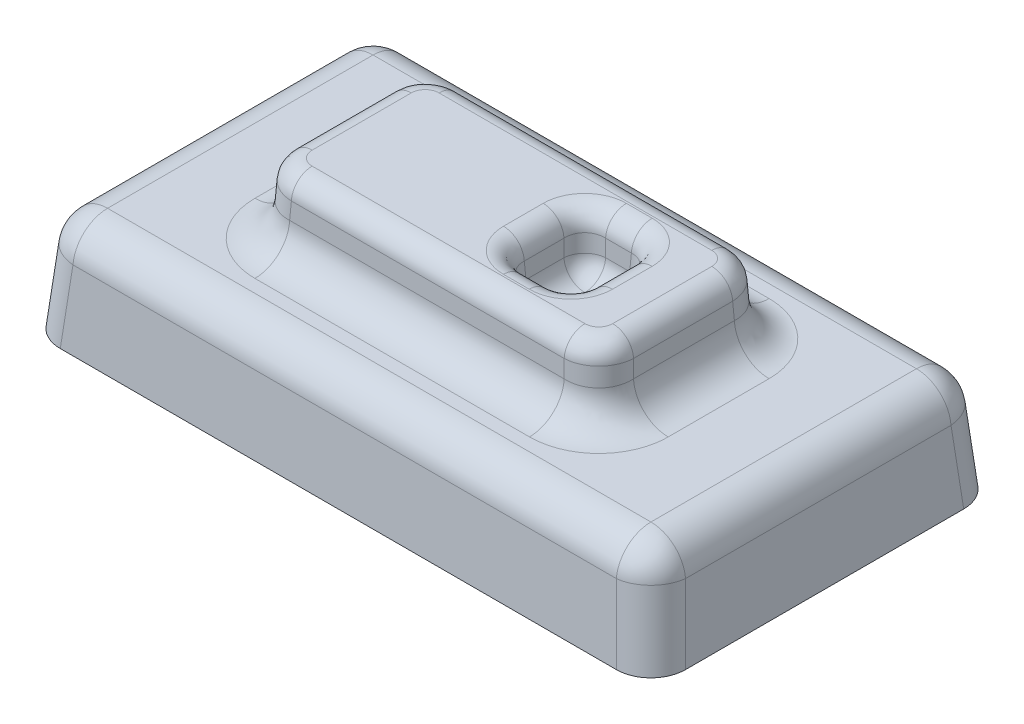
from build123d import *

# Parameters (mm, degrees)
SKETCH_1_W          = 180
SKETCH_1_H          = 100
EXTRUDE_1_DEPTH     = 30
EXTRUDE_1_TAPER     = 5
SKETCH_2_W          = 100
SKETCH_2_H          = 50
EXTRUDE_2_DEPTH     = 20
EXTRUDE_2_TAPER     = 3
SKETCH_3_W          = 20
SKETCH_3_H          = 24
CUT_EXTRUDE_3_DEPTH = 16
CUT_EXTRUDE_3_DRAFT = -3
FILLET_1_R          = 10
FILLET_2_R          = 6


with BuildPart() as part:
    # Sketch 1 → Extrude 1 (new body)
    with BuildSketch(Plane(origin=(0, 0, 0), x_dir=(1, 0, 0), z_dir=(0, 1, 0))):
        Rectangle(SKETCH_1_W, SKETCH_1_H)
    extrude(amount=EXTRUDE_1_DEPTH, taper=EXTRUDE_1_TAPER)

    # Sketch 2 → Extrude 2 (add)
    with BuildSketch(Plane(origin=(0, 30, 0), x_dir=(1, 0, 0), z_dir=(0, 1, 0))):
        Rectangle(SKETCH_2_W, SKETCH_2_H)
    extrude(amount=EXTRUDE_2_DEPTH, taper=EXTRUDE_2_TAPER)


with BuildPart() as cut_extrude_3_tool:
    # Sketch 3 → Cut-Extrude 3 (with draft: the straight prism first)
    with BuildSketch(Plane(origin=(0, 50, 0), x_dir=(1, 0, 0), z_dir=(0, 1, 0))):
        with Locations((18.951844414, 0)):
            Rectangle(SKETCH_3_W, SKETCH_3_H)
    extrude(amount=-CUT_EXTRUDE_3_DEPTH)
    # Cut-Extrude 3: the draft: its side faces are tilted about the plane it starts from
    cut_extrude_3_sides = [cut_extrude_3_tool.faces().sort_by_distance(p)[0] for p in [
        (8.951844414, 42, 0),
        (18.951844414, 42, 12),
        (28.951844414, 42, 0),
        (18.951844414, 42, -12),
    ]]
    draft(cut_extrude_3_sides, Plane(origin=(0, 50, 0), x_dir=(1, 0, 0), z_dir=(0, 1, 0)), CUT_EXTRUDE_3_DRAFT)


with BuildPart() as part_1:
    add(part.part)

    # Cut-Extrude 3: cut by cut_extrude_3_tool
    add(cut_extrude_3_tool.part, mode=Mode.SUBTRACT)

    # Fillet 1
    fillet_1_edges = [part_1.edges().sort_by_distance(p)[0] for p in [
        (87.375340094, 30, 0),
        (0, 30, -47.375340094),
        (50, 30, 0),
        (49.475922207, 40, 24.475922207),
        (0, 30, -25),
        (49.475922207, 40, -24.475922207),
        (-50, 30, 0),
        (-49.475922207, 40, -24.475922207),
        (0, 30, 25),
        (-49.475922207, 40, 24.475922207),
        (-87.375340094, 30, 0),
        (0, 30, 47.375340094),
        (-88.687670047, 15, -48.687670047),
        (88.687670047, 15, -48.687670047),
        (88.687670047, 15, 48.687670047),
        (-88.687670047, 15, 48.687670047),
    ]]
    fillet(fillet_1_edges, radius=FILLET_1_R)

    # Fillet 2
    fillet_2_edges = [part_1.edges().sort_by_distance(p)[0] for p in [
        (9.790368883, 34, 0),
        (9.371106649, 42, 11.580737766),
        (18.951844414, 34, -11.161475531),
        (9.371106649, 42, -11.580737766),
        (28.113319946, 34, 0),
        (28.53258218, 42, -11.580737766),
        (18.951844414, 34, 11.161475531),
        (28.53258218, 42, 11.580737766),
        (8.951844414, 50, 0),
        (18.951844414, 50, 12),
        (28.951844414, 50, 0),
        (18.951844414, 50, -12),
        (-48.951844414, 50, 0),
        (0, 50, 23.951844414),
        (48.951844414, 50, 0),
        (0, 50, -23.951844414),
        (46.028583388, 50, 21.028583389),
        (46.028583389, 50, -21.028583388),
        (-46.028583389, 50, 21.028583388),
        (-46.028583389, 50, -21.028583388),
    ]]
    fillet(fillet_2_edges, radius=FILLET_2_R)


solid = part_1.part
